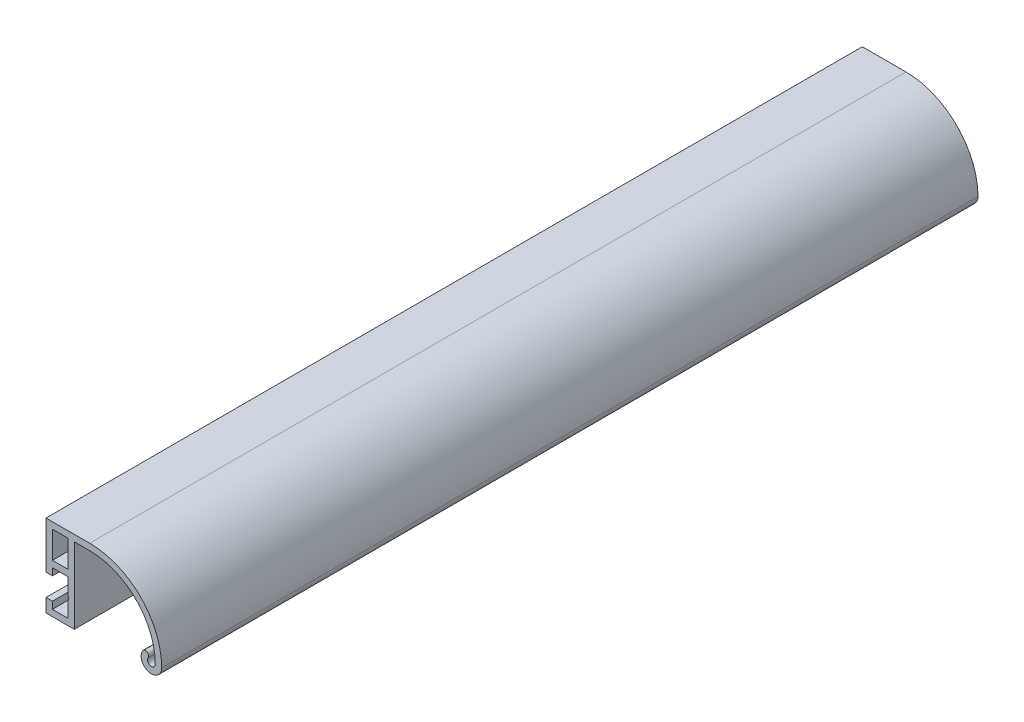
ISO-10303-21;
HEADER;
FILE_DESCRIPTION(('STEP AP214'),'2;1');
FILE_NAME('part.step','',(''),(''),'','','');
FILE_SCHEMA(('AUTOMOTIVE_DESIGN { 1 0 10303 214 1 1 1 1 }'));
ENDSEC;
DATA;
#1=APPLICATION_CONTEXT('core data for automotive mechanical design processes');
#2=APPLICATION_PROTOCOL_DEFINITION('international standard','automotive_design',2000,#1);
#3=PRODUCT_CONTEXT('',#1,'mechanical');
#4=PRODUCT('Part','Part','',(#3));
#5=PRODUCT_RELATED_PRODUCT_CATEGORY('part','',(#4));
#6=PRODUCT_DEFINITION_FORMATION('','',#4);
#7=PRODUCT_DEFINITION_CONTEXT('part definition',#1,'design');
#8=PRODUCT_DEFINITION('design','',#6,#7);
#9=PRODUCT_DEFINITION_SHAPE('','',#8);
#10=(LENGTH_UNIT() NAMED_UNIT(*) SI_UNIT(.MILLI.,.METRE.));
#11=(NAMED_UNIT(*) PLANE_ANGLE_UNIT() SI_UNIT($,.RADIAN.));
#12=(NAMED_UNIT(*) SI_UNIT($,.STERADIAN.) SOLID_ANGLE_UNIT());
#13=UNCERTAINTY_MEASURE_WITH_UNIT(LENGTH_MEASURE(1.E-05),#10,'distance_accuracy_value','');
#14=(GEOMETRIC_REPRESENTATION_CONTEXT(3) GLOBAL_UNCERTAINTY_ASSIGNED_CONTEXT((#13)) GLOBAL_UNIT_ASSIGNED_CONTEXT((#10,
#11,#12)) REPRESENTATION_CONTEXT('',''));
#15=CARTESIAN_POINT('',(0.,0.,0.));
#16=DIRECTION('',(0.,0.,1.));
#17=DIRECTION('',(1.,0.,0.));
#18=AXIS2_PLACEMENT_3D('',#15,#16,#17);
#19=CARTESIAN_POINT('',(-13.9999990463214,0.499999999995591,-158.75));
#20=DIRECTION('',(-0.707106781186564,-0.707106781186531,0.));
#21=DIRECTION('',(0.707106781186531,-0.707106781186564,0.));
#22=AXIS2_PLACEMENT_3D('',#19,#20,#21);
#23=PLANE('',#22);
#24=CARTESIAN_POINT('',(-13.4999990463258,0.,120.65));
#25=DIRECTION('',(-0.707106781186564,-0.707106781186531,0.));
#26=DIRECTION('',(0.707106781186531,-0.707106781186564,0.));
#27=AXIS2_PLACEMENT_3D('',#24,#25,#26);
#28=ELLIPSE('',#27,5.65685424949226,4.00000000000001);
#29=CARTESIAN_POINT('',(-13.4999990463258,0.,124.65));
#30=VERTEX_POINT('',#29);
#31=CARTESIAN_POINT('',(-13.9999990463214,0.499999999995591,124.618626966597));
#32=VERTEX_POINT('',#31);
#33=EDGE_CURVE('E60',#30,#32,#28,.T.);
#34=ORIENTED_EDGE('',*,*,#33,.F.);
#35=DIRECTION('',(0.,0.,1.));
#36=VECTOR('',#35,1.);
#37=CARTESIAN_POINT('',(-13.4999990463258,0.,-158.75));
#38=LINE('',#37,#36);
#39=CARTESIAN_POINT('',(-13.4999990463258,0.,158.75));
#40=VERTEX_POINT('',#39);
#41=EDGE_CURVE('E297',#30,#40,#38,.T.);
#42=ORIENTED_EDGE('',*,*,#41,.T.);
#43=DIRECTION('',(0.707106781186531,-0.707106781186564,0.));
#44=VECTOR('',#43,1.);
#45=CARTESIAN_POINT('',(-13.9999990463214,0.499999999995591,158.75));
#46=LINE('',#45,#44);
#47=CARTESIAN_POINT('',(-13.9999990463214,0.499999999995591,158.75));
#48=VERTEX_POINT('',#47);
#49=EDGE_CURVE('E394',#48,#40,#46,.T.);
#50=ORIENTED_EDGE('',*,*,#49,.F.);
#51=DIRECTION('',(0.,0.,1.));
#52=VECTOR('',#51,1.);
#53=CARTESIAN_POINT('',(-13.9999990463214,0.499999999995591,-158.75));
#54=LINE('',#53,#52);
#55=EDGE_CURVE('E292',#32,#48,#54,.T.);
#56=ORIENTED_EDGE('',*,*,#55,.F.);
#57=EDGE_LOOP('',(#34,#42,#50,#56));
#58=FACE_BOUND('',#57,.T.);
#59=ADVANCED_FACE('F39',(#58),#23,.T.);
#60=CARTESIAN_POINT('',(-13.4999990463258,0.,-158.75));
#61=DIRECTION('',(-0.70710678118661,0.707106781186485,0.));
#62=DIRECTION('',(-0.707106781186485,-0.70710678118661,0.));
#63=AXIS2_PLACEMENT_3D('',#60,#61,#62);
#64=PLANE('',#63);
#65=CARTESIAN_POINT('',(-13.4999990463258,0.,120.65));
#66=DIRECTION('',(-0.70710678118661,0.707106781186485,0.));
#67=DIRECTION('',(0.707106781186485,0.70710678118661,0.));
#68=AXIS2_PLACEMENT_3D('',#65,#66,#67);
#69=ELLIPSE('',#68,5.65685424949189,4.00000000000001);
#70=CARTESIAN_POINT('',(-13.4999990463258,0.,116.65));
#71=VERTEX_POINT('',#70);
#72=CARTESIAN_POINT('',(-13.9999990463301,-0.500000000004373,116.681373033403));
#73=VERTEX_POINT('',#72);
#74=EDGE_CURVE('E677',#71,#73,#69,.T.);
#75=ORIENTED_EDGE('',*,*,#74,.F.);
#76=CARTESIAN_POINT('',(-13.4999990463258,0.,-116.65));
#77=VERTEX_POINT('',#76);
#78=EDGE_CURVE('E284',#77,#71,#38,.T.);
#79=ORIENTED_EDGE('',*,*,#78,.F.);
#80=CARTESIAN_POINT('',(-13.4999990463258,0.,-120.65));
#81=DIRECTION('',(-0.70710678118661,0.707106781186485,0.));
#82=DIRECTION('',(0.707106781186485,0.70710678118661,0.));
#83=AXIS2_PLACEMENT_3D('',#80,#81,#82);
#84=ELLIPSE('',#83,5.65685424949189,4.00000000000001);
#85=CARTESIAN_POINT('',(-13.9999990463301,-0.500000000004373,-116.681373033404));
#86=VERTEX_POINT('',#85);
#87=EDGE_CURVE('E520',#86,#77,#84,.T.);
#88=ORIENTED_EDGE('',*,*,#87,.F.);
#89=DIRECTION('',(0.,0.,1.));
#90=VECTOR('',#89,1.);
#91=CARTESIAN_POINT('',(-13.9999990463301,-0.500000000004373,-158.75));
#92=LINE('',#91,#90);
#93=EDGE_CURVE('E370',#86,#73,#92,.T.);
#94=ORIENTED_EDGE('',*,*,#93,.T.);
#95=EDGE_LOOP('',(#75,#79,#88,#94));
#96=FACE_BOUND('',#95,.T.);
#97=ADVANCED_FACE('F652',(#96),#64,.T.);
#98=CARTESIAN_POINT('',(-13.4999990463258,0.,-124.65));
#99=VERTEX_POINT('',#98);
#100=CARTESIAN_POINT('',(-13.9999990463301,-0.500000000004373,-124.618626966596));
#101=VERTEX_POINT('',#100);
#102=EDGE_CURVE('E517',#99,#101,#84,.T.);
#103=ORIENTED_EDGE('',*,*,#102,.F.);
#104=CARTESIAN_POINT('',(-13.4999990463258,0.,-158.75));
#105=VERTEX_POINT('',#104);
#106=EDGE_CURVE('E302',#105,#99,#38,.T.);
#107=ORIENTED_EDGE('',*,*,#106,.F.);
#108=DIRECTION('',(-0.707106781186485,-0.70710678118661,0.));
#109=VECTOR('',#108,1.);
#110=CARTESIAN_POINT('',(-13.4999990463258,0.,-158.75));
#111=LINE('',#110,#109);
#112=CARTESIAN_POINT('',(-13.9999990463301,-0.500000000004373,-158.75));
#113=VERTEX_POINT('',#112);
#114=EDGE_CURVE('E501',#105,#113,#111,.T.);
#115=ORIENTED_EDGE('',*,*,#114,.T.);
#116=EDGE_CURVE('E367',#113,#101,#92,.T.);
#117=ORIENTED_EDGE('',*,*,#116,.T.);
#118=EDGE_LOOP('',(#103,#107,#115,#117));
#119=FACE_BOUND('',#118,.T.);
#120=ADVANCED_FACE('F516',(#119),#64,.T.);
#121=CARTESIAN_POINT('',(-13.9999990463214,0.499999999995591,116.681373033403));
#122=VERTEX_POINT('',#121);
#123=EDGE_CURVE('E270',#122,#71,#28,.T.);
#124=ORIENTED_EDGE('',*,*,#123,.F.);
#125=CARTESIAN_POINT('',(-13.9999990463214,0.499999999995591,-116.681373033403));
#126=VERTEX_POINT('',#125);
#127=EDGE_CURVE('E282',#126,#122,#54,.T.);
#128=ORIENTED_EDGE('',*,*,#127,.F.);
#129=CARTESIAN_POINT('',(-13.4999990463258,0.,-120.65));
#130=DIRECTION('',(-0.707106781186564,-0.707106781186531,0.));
#131=DIRECTION('',(0.707106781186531,-0.707106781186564,0.));
#132=AXIS2_PLACEMENT_3D('',#129,#130,#131);
#133=ELLIPSE('',#132,5.65685424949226,4.00000000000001);
#134=EDGE_CURVE('E68',#77,#126,#133,.T.);
#135=ORIENTED_EDGE('',*,*,#134,.F.);
#136=ORIENTED_EDGE('',*,*,#78,.T.);
#137=EDGE_LOOP('',(#124,#128,#135,#136));
#138=FACE_BOUND('',#137,.T.);
#139=ADVANCED_FACE('F281',(#138),#23,.T.);
#140=CARTESIAN_POINT('',(-19.9999990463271,-4.2500000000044,-158.75));
#141=DIRECTION('',(0.,1.,0.));
#142=DIRECTION('',(-1.,0.,0.));
#143=AXIS2_PLACEMENT_3D('',#140,#141,#142);
#144=PLANE('',#143);
#145=DIRECTION('',(0.,0.,1.));
#146=VECTOR('',#145,1.);
#147=CARTESIAN_POINT('',(-22.4999990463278,-4.25000000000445,-158.75));
#148=LINE('',#147,#146);
#149=CARTESIAN_POINT('',(-22.4999990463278,-4.25000000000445,-158.75));
#150=VERTEX_POINT('',#149);
#151=CARTESIAN_POINT('',(-22.4999990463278,-4.25000000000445,158.75));
#152=VERTEX_POINT('',#151);
#153=EDGE_CURVE('E43',#150,#152,#148,.T.);
#154=ORIENTED_EDGE('',*,*,#153,.T.);
#155=DIRECTION('',(-1.,0.,0.));
#156=VECTOR('',#155,1.);
#157=CARTESIAN_POINT('',(-19.9999990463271,-4.2500000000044,158.75));
#158=LINE('',#157,#156);
#159=CARTESIAN_POINT('',(-19.9999990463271,-4.2500000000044,158.75));
#160=VERTEX_POINT('',#159);
#161=EDGE_CURVE('E540',#160,#152,#158,.T.);
#162=ORIENTED_EDGE('',*,*,#161,.F.);
#163=DIRECTION('',(0.,0.,1.));
#164=VECTOR('',#163,1.);
#165=CARTESIAN_POINT('',(-19.9999990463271,-4.2500000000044,-158.75));
#166=LINE('',#165,#164);
#167=CARTESIAN_POINT('',(-19.9999990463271,-4.2500000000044,-158.75));
#168=VERTEX_POINT('',#167);
#169=EDGE_CURVE('E11',#168,#160,#166,.T.);
#170=ORIENTED_EDGE('',*,*,#169,.F.);
#171=DIRECTION('',(-1.,0.,0.));
#172=VECTOR('',#171,1.);
#173=CARTESIAN_POINT('',(-19.9999990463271,-4.2500000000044,-158.75));
#174=LINE('',#173,#172);
#175=EDGE_CURVE('E435',#168,#150,#174,.T.);
#176=ORIENTED_EDGE('',*,*,#175,.T.);
#177=EDGE_LOOP('',(#154,#162,#170,#176));
#178=FACE_BOUND('',#177,.T.);
#179=ADVANCED_FACE('F41',(#178),#144,.T.);
#180=CARTESIAN_POINT('',(-19.9999990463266,-7.0000000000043,-158.75));
#181=DIRECTION('',(1.,1.58963751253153E-13,0.));
#182=DIRECTION('',(-1.58963751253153E-13,1.,0.));
#183=AXIS2_PLACEMENT_3D('',#180,#181,#182);
#184=PLANE('',#183);
#185=ORIENTED_EDGE('',*,*,#169,.T.);
#186=DIRECTION('',(-1.58963751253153E-13,1.,0.));
#187=VECTOR('',#186,1.);
#188=CARTESIAN_POINT('',(-19.9999990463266,-7.0000000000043,158.75));
#189=LINE('',#188,#187);
#190=CARTESIAN_POINT('',(-19.9999990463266,-7.0000000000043,158.75));
#191=VERTEX_POINT('',#190);
#192=EDGE_CURVE('E416',#191,#160,#189,.T.);
#193=ORIENTED_EDGE('',*,*,#192,.F.);
#194=DIRECTION('',(0.,0.,1.));
#195=VECTOR('',#194,1.);
#196=CARTESIAN_POINT('',(-19.9999990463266,-7.0000000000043,-158.75));
#197=LINE('',#196,#195);
#198=CARTESIAN_POINT('',(-19.9999990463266,-7.0000000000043,-158.75));
#199=VERTEX_POINT('',#198);
#200=EDGE_CURVE('E49',#199,#191,#197,.T.);
#201=ORIENTED_EDGE('',*,*,#200,.F.);
#202=DIRECTION('',(-1.58963751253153E-13,1.,0.));
#203=VECTOR('',#202,1.);
#204=CARTESIAN_POINT('',(-19.9999990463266,-7.0000000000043,-158.75));
#205=LINE('',#204,#203);
#206=EDGE_CURVE('E345',#199,#168,#205,.T.);
#207=ORIENTED_EDGE('',*,*,#206,.T.);
#208=EDGE_LOOP('',(#185,#193,#201,#207));
#209=FACE_BOUND('',#208,.T.);
#210=ADVANCED_FACE('F639',(#209),#184,.T.);
#211=CARTESIAN_POINT('',(-13.9999990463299,-7.00000000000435,-158.75));
#212=DIRECTION('',(0.,1.,0.));
#213=DIRECTION('',(-1.,0.,0.));
#214=AXIS2_PLACEMENT_3D('',#211,#212,#213);
#215=PLANE('',#214);
#216=ORIENTED_EDGE('',*,*,#200,.T.);
#217=DIRECTION('',(-1.,0.,0.));
#218=VECTOR('',#217,1.);
#219=CARTESIAN_POINT('',(-13.9999990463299,-7.00000000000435,158.75));
#220=LINE('',#219,#218);
#221=CARTESIAN_POINT('',(-13.9999990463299,-7.00000000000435,158.75));
#222=VERTEX_POINT('',#221);
#223=EDGE_CURVE('E410',#222,#191,#220,.T.);
#224=ORIENTED_EDGE('',*,*,#223,.F.);
#225=DIRECTION('',(0.,0.,1.));
#226=VECTOR('',#225,1.);
#227=CARTESIAN_POINT('',(-13.9999990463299,-7.00000000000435,-158.75));
#228=LINE('',#227,#226);
#229=CARTESIAN_POINT('',(-13.9999990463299,-7.00000000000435,-158.75));
#230=VERTEX_POINT('',#229);
#231=EDGE_CURVE('E366',#230,#222,#228,.T.);
#232=ORIENTED_EDGE('',*,*,#231,.F.);
#233=DIRECTION('',(-1.,0.,0.));
#234=VECTOR('',#233,1.);
#235=CARTESIAN_POINT('',(-13.9999990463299,-7.00000000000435,-158.75));
#236=LINE('',#235,#234);
#237=EDGE_CURVE('E352',#230,#199,#236,.T.);
#238=ORIENTED_EDGE('',*,*,#237,.T.);
#239=EDGE_LOOP('',(#216,#224,#232,#238));
#240=FACE_BOUND('',#239,.T.);
#241=ADVANCED_FACE('F642',(#240),#215,.T.);
#242=CARTESIAN_POINT('',(-13.9999990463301,-0.500000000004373,-158.75));
#243=DIRECTION('',(-1.,0.,0.));
#244=DIRECTION('',(0.,-1.,0.));
#245=AXIS2_PLACEMENT_3D('',#242,#243,#244);
#246=PLANE('',#245);
#247=CARTESIAN_POINT('',(-13.9999990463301,0.,120.65));
#248=DIRECTION('',(-1.,0.,0.));
#249=DIRECTION('',(0.,-1.,0.));
#250=AXIS2_PLACEMENT_3D('',#247,#248,#249);
#251=CIRCLE('',#250,4.00000000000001);
#252=CARTESIAN_POINT('',(-13.9999990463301,-0.500000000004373,124.618626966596));
#253=VERTEX_POINT('',#252);
#254=EDGE_CURVE('E672',#73,#253,#251,.T.);
#255=ORIENTED_EDGE('',*,*,#254,.F.);
#256=ORIENTED_EDGE('',*,*,#93,.F.);
#257=CARTESIAN_POINT('',(-13.9999990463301,0.,-120.65));
#258=DIRECTION('',(-1.,0.,0.));
#259=DIRECTION('',(0.,-1.,0.));
#260=AXIS2_PLACEMENT_3D('',#257,#258,#259);
#261=CIRCLE('',#260,4.00000000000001);
#262=EDGE_CURVE('E519',#101,#86,#261,.T.);
#263=ORIENTED_EDGE('',*,*,#262,.F.);
#264=ORIENTED_EDGE('',*,*,#116,.F.);
#265=DIRECTION('',(0.,-1.,0.));
#266=VECTOR('',#265,1.);
#267=CARTESIAN_POINT('',(-13.9999990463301,-0.500000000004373,-158.75));
#268=LINE('',#267,#266);
#269=EDGE_CURVE('E360',#113,#230,#268,.T.);
#270=ORIENTED_EDGE('',*,*,#269,.T.);
#271=ORIENTED_EDGE('',*,*,#231,.T.);
#272=DIRECTION('',(0.,-1.,0.));
#273=VECTOR('',#272,1.);
#274=CARTESIAN_POINT('',(-13.9999990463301,-0.500000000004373,158.75));
#275=LINE('',#274,#273);
#276=CARTESIAN_POINT('',(-13.9999990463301,-0.500000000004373,158.75));
#277=VERTEX_POINT('',#276);
#278=EDGE_CURVE('E408',#277,#222,#275,.T.);
#279=ORIENTED_EDGE('',*,*,#278,.F.);
#280=EDGE_CURVE('E371',#253,#277,#92,.T.);
#281=ORIENTED_EDGE('',*,*,#280,.F.);
#282=EDGE_LOOP('',(#255,#256,#263,#264,#270,#271,#279,#281));
#283=FACE_BOUND('',#282,.T.);
#284=ADVANCED_FACE('F508',(#283),#246,.T.);
#285=EDGE_CURVE('E678',#253,#30,#69,.T.);
#286=ORIENTED_EDGE('',*,*,#285,.F.);
#287=ORIENTED_EDGE('',*,*,#280,.T.);
#288=DIRECTION('',(-0.707106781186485,-0.70710678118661,0.));
#289=VECTOR('',#288,1.);
#290=CARTESIAN_POINT('',(-13.4999990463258,0.,158.75));
#291=LINE('',#290,#289);
#292=EDGE_CURVE('E401',#40,#277,#291,.T.);
#293=ORIENTED_EDGE('',*,*,#292,.F.);
#294=ORIENTED_EDGE('',*,*,#41,.F.);
#295=EDGE_LOOP('',(#286,#287,#293,#294));
#296=FACE_BOUND('',#295,.T.);
#297=ADVANCED_FACE('F407',(#296),#64,.T.);
#298=CARTESIAN_POINT('',(-13.9999990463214,0.499999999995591,-124.618626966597));
#299=VERTEX_POINT('',#298);
#300=EDGE_CURVE('E526',#299,#99,#133,.T.);
#301=ORIENTED_EDGE('',*,*,#300,.F.);
#302=CARTESIAN_POINT('',(-13.9999990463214,0.499999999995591,-158.75));
#303=VERTEX_POINT('',#302);
#304=EDGE_CURVE('E291',#303,#299,#54,.T.);
#305=ORIENTED_EDGE('',*,*,#304,.F.);
#306=DIRECTION('',(0.707106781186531,-0.707106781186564,0.));
#307=VECTOR('',#306,1.);
#308=CARTESIAN_POINT('',(-13.9999990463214,0.499999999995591,-158.75));
#309=LINE('',#308,#307);
#310=EDGE_CURVE('E498',#303,#105,#309,.T.);
#311=ORIENTED_EDGE('',*,*,#310,.T.);
#312=ORIENTED_EDGE('',*,*,#106,.T.);
#313=EDGE_LOOP('',(#301,#305,#311,#312));
#314=FACE_BOUND('',#313,.T.);
#315=ADVANCED_FACE('F654',(#314),#23,.T.);
#316=CARTESIAN_POINT('',(-13.9999990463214,6.99999999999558,-158.75));
#317=DIRECTION('',(-1.,0.,0.));
#318=DIRECTION('',(0.,-1.,0.));
#319=AXIS2_PLACEMENT_3D('',#316,#317,#318);
#320=PLANE('',#319);
#321=CARTESIAN_POINT('',(-13.9999990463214,0.,120.65));
#322=DIRECTION('',(-1.,0.,0.));
#323=DIRECTION('',(0.,-1.,0.));
#324=AXIS2_PLACEMENT_3D('',#321,#322,#323);
#325=CIRCLE('',#324,4.00000000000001);
#326=EDGE_CURVE('E266',#32,#122,#325,.T.);
#327=ORIENTED_EDGE('',*,*,#326,.F.);
#328=ORIENTED_EDGE('',*,*,#55,.T.);
#329=DIRECTION('',(0.,-1.,0.));
#330=VECTOR('',#329,1.);
#331=CARTESIAN_POINT('',(-13.9999990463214,6.99999999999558,158.75));
#332=LINE('',#331,#330);
#333=CARTESIAN_POINT('',(-13.9999990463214,6.99999999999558,158.75));
#334=VERTEX_POINT('',#333);
#335=EDGE_CURVE('E405',#334,#48,#332,.T.);
#336=ORIENTED_EDGE('',*,*,#335,.F.);
#337=DIRECTION('',(0.,0.,1.));
#338=VECTOR('',#337,1.);
#339=CARTESIAN_POINT('',(-13.9999990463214,6.99999999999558,-158.75));
#340=LINE('',#339,#338);
#341=CARTESIAN_POINT('',(-13.9999990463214,6.99999999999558,-158.75));
#342=VERTEX_POINT('',#341);
#343=EDGE_CURVE('E299',#342,#334,#340,.T.);
#344=ORIENTED_EDGE('',*,*,#343,.F.);
#345=DIRECTION('',(0.,-1.,0.));
#346=VECTOR('',#345,1.);
#347=CARTESIAN_POINT('',(-13.9999990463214,6.99999999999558,-158.75));
#348=LINE('',#347,#346);
#349=EDGE_CURVE('E494',#342,#303,#348,.T.);
#350=ORIENTED_EDGE('',*,*,#349,.T.);
#351=ORIENTED_EDGE('',*,*,#304,.T.);
#352=CARTESIAN_POINT('',(-13.9999990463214,0.,-120.65));
#353=DIRECTION('',(-1.,0.,0.));
#354=DIRECTION('',(0.,-1.,0.));
#355=AXIS2_PLACEMENT_3D('',#352,#353,#354);
#356=CIRCLE('',#355,4.00000000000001);
#357=EDGE_CURVE('E289',#126,#299,#356,.T.);
#358=ORIENTED_EDGE('',*,*,#357,.F.);
#359=ORIENTED_EDGE('',*,*,#127,.T.);
#360=EDGE_LOOP('',(#327,#328,#336,#344,#350,#351,#358,#359));
#361=FACE_BOUND('',#360,.T.);
#362=ADVANCED_FACE('F287',(#361),#320,.T.);
#363=CARTESIAN_POINT('',(-19.9999990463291,6.99999999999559,-158.75));
#364=DIRECTION('',(0.,-1.,0.));
#365=DIRECTION('',(1.,0.,0.));
#366=AXIS2_PLACEMENT_3D('',#363,#364,#365);
#367=PLANE('',#366);
#368=ORIENTED_EDGE('',*,*,#343,.T.);
#369=DIRECTION('',(1.,0.,0.));
#370=VECTOR('',#369,1.);
#371=CARTESIAN_POINT('',(-19.9999990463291,6.99999999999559,158.75));
#372=LINE('',#371,#370);
#373=CARTESIAN_POINT('',(-19.9999990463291,6.99999999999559,158.75));
#374=VERTEX_POINT('',#373);
#375=EDGE_CURVE('E582',#374,#334,#372,.T.);
#376=ORIENTED_EDGE('',*,*,#375,.F.);
#377=DIRECTION('',(0.,0.,1.));
#378=VECTOR('',#377,1.);
#379=CARTESIAN_POINT('',(-19.9999990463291,6.99999999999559,-158.75));
#380=LINE('',#379,#378);
#381=CARTESIAN_POINT('',(-19.9999990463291,6.99999999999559,-158.75));
#382=VERTEX_POINT('',#381);
#383=EDGE_CURVE('E306',#382,#374,#380,.T.);
#384=ORIENTED_EDGE('',*,*,#383,.F.);
#385=DIRECTION('',(1.,0.,0.));
#386=VECTOR('',#385,1.);
#387=CARTESIAN_POINT('',(-19.9999990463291,6.99999999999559,-158.75));
#388=LINE('',#387,#386);
#389=EDGE_CURVE('E491',#382,#342,#388,.T.);
#390=ORIENTED_EDGE('',*,*,#389,.T.);
#391=EDGE_LOOP('',(#368,#376,#384,#390));
#392=FACE_BOUND('',#391,.T.);
#393=ADVANCED_FACE('F589',(#392),#367,.T.);
#394=CARTESIAN_POINT('',(-19.9999990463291,4.24999999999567,-158.75));
#395=DIRECTION('',(1.,0.,0.));
#396=DIRECTION('',(0.,1.,0.));
#397=AXIS2_PLACEMENT_3D('',#394,#395,#396);
#398=PLANE('',#397);
#399=ORIENTED_EDGE('',*,*,#383,.T.);
#400=DIRECTION('',(0.,1.,0.));
#401=VECTOR('',#400,1.);
#402=CARTESIAN_POINT('',(-19.9999990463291,4.24999999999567,158.75));
#403=LINE('',#402,#401);
#404=CARTESIAN_POINT('',(-19.9999990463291,4.24999999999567,158.75));
#405=VERTEX_POINT('',#404);
#406=EDGE_CURVE('E579',#405,#374,#403,.T.);
#407=ORIENTED_EDGE('',*,*,#406,.F.);
#408=DIRECTION('',(0.,0.,1.));
#409=VECTOR('',#408,1.);
#410=CARTESIAN_POINT('',(-19.9999990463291,4.24999999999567,-158.75));
#411=LINE('',#410,#409);
#412=CARTESIAN_POINT('',(-19.9999990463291,4.24999999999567,-158.75));
#413=VERTEX_POINT('',#412);
#414=EDGE_CURVE('E309',#413,#405,#411,.T.);
#415=ORIENTED_EDGE('',*,*,#414,.F.);
#416=DIRECTION('',(0.,1.,0.));
#417=VECTOR('',#416,1.);
#418=CARTESIAN_POINT('',(-19.9999990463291,4.24999999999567,-158.75));
#419=LINE('',#418,#417);
#420=EDGE_CURVE('E487',#413,#382,#419,.T.);
#421=ORIENTED_EDGE('',*,*,#420,.T.);
#422=EDGE_LOOP('',(#399,#407,#415,#421));
#423=FACE_BOUND('',#422,.T.);
#424=ADVANCED_FACE('F591',(#423),#398,.T.);
#425=CARTESIAN_POINT('',(-22.4999990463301,4.2499999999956,-158.75));
#426=DIRECTION('',(0.,-1.,0.));
#427=DIRECTION('',(1.,0.,0.));
#428=AXIS2_PLACEMENT_3D('',#425,#426,#427);
#429=PLANE('',#428);
#430=ORIENTED_EDGE('',*,*,#414,.T.);
#431=DIRECTION('',(1.,0.,0.));
#432=VECTOR('',#431,1.);
#433=CARTESIAN_POINT('',(-22.4999990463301,4.2499999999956,158.75));
#434=LINE('',#433,#432);
#435=CARTESIAN_POINT('',(-22.4999990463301,4.2499999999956,158.75));
#436=VERTEX_POINT('',#435);
#437=EDGE_CURVE('E576',#436,#405,#434,.T.);
#438=ORIENTED_EDGE('',*,*,#437,.F.);
#439=DIRECTION('',(0.,0.,1.));
#440=VECTOR('',#439,1.);
#441=CARTESIAN_POINT('',(-22.4999990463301,4.2499999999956,-158.75));
#442=LINE('',#441,#440);
#443=CARTESIAN_POINT('',(-22.4999990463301,4.2499999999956,-158.75));
#444=VERTEX_POINT('',#443);
#445=EDGE_CURVE('E312',#444,#436,#442,.T.);
#446=ORIENTED_EDGE('',*,*,#445,.F.);
#447=DIRECTION('',(1.,0.,0.));
#448=VECTOR('',#447,1.);
#449=CARTESIAN_POINT('',(-22.4999990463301,4.2499999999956,-158.75));
#450=LINE('',#449,#448);
#451=EDGE_CURVE('E483',#444,#413,#450,.T.);
#452=ORIENTED_EDGE('',*,*,#451,.T.);
#453=EDGE_LOOP('',(#430,#438,#446,#452));
#454=FACE_BOUND('',#453,.T.);
#455=ADVANCED_FACE('F595',(#454),#429,.T.);
#456=CARTESIAN_POINT('',(-22.4999990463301,22.499998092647,-158.75));
#457=DIRECTION('',(-1.,0.,0.));
#458=DIRECTION('',(0.,0.,1.));
#459=AXIS2_PLACEMENT_3D('',#456,#457,#458);
#460=PLANE('',#459);
#461=ORIENTED_EDGE('',*,*,#445,.T.);
#462=DIRECTION('',(0.,-1.,0.));
#463=VECTOR('',#462,1.);
#464=CARTESIAN_POINT('',(-22.4999990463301,22.499998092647,158.75));
#465=LINE('',#464,#463);
#466=CARTESIAN_POINT('',(-22.4999990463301,22.499998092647,158.75));
#467=VERTEX_POINT('',#466);
#468=EDGE_CURVE('E573',#467,#436,#465,.T.);
#469=ORIENTED_EDGE('',*,*,#468,.F.);
#470=DIRECTION('',(0.,0.,1.));
#471=VECTOR('',#470,1.);
#472=CARTESIAN_POINT('',(-22.4999990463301,22.499998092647,-158.75));
#473=LINE('',#472,#471);
#474=CARTESIAN_POINT('',(-22.4999990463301,22.499998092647,-158.75));
#475=VERTEX_POINT('',#474);
#476=EDGE_CURVE('E315',#475,#467,#473,.T.);
#477=ORIENTED_EDGE('',*,*,#476,.F.);
#478=DIRECTION('',(0.,-1.,0.));
#479=VECTOR('',#478,1.);
#480=CARTESIAN_POINT('',(-22.4999990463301,22.499998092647,-158.75));
#481=LINE('',#480,#479);
#482=EDGE_CURVE('E479',#475,#444,#481,.T.);
#483=ORIENTED_EDGE('',*,*,#482,.T.);
#484=EDGE_LOOP('',(#461,#469,#477,#483));
#485=FACE_BOUND('',#484,.T.);
#486=ADVANCED_FACE('F599',(#485),#460,.T.);
#487=CARTESIAN_POINT('',(-5.4999990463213,22.499998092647,-158.75));
#488=DIRECTION('',(0.,1.,0.));
#489=DIRECTION('',(-1.,0.,0.));
#490=AXIS2_PLACEMENT_3D('',#487,#488,#489);
#491=PLANE('',#490);
#492=ORIENTED_EDGE('',*,*,#476,.T.);
#493=DIRECTION('',(-1.,0.,0.));
#494=VECTOR('',#493,1.);
#495=CARTESIAN_POINT('',(-5.4999990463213,22.499998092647,158.75));
#496=LINE('',#495,#494);
#497=CARTESIAN_POINT('',(-5.4999990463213,22.499998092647,158.75));
#498=VERTEX_POINT('',#497);
#499=EDGE_CURVE('E570',#498,#467,#496,.T.);
#500=ORIENTED_EDGE('',*,*,#499,.F.);
#501=DIRECTION('',(0.,0.,1.));
#502=VECTOR('',#501,1.);
#503=CARTESIAN_POINT('',(-5.4999990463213,22.499998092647,-158.75));
#504=LINE('',#503,#502);
#505=CARTESIAN_POINT('',(-5.4999990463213,22.499998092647,-158.75));
#506=VERTEX_POINT('',#505);
#507=EDGE_CURVE('E317',#506,#498,#504,.T.);
#508=ORIENTED_EDGE('',*,*,#507,.F.);
#509=DIRECTION('',(-1.,0.,0.));
#510=VECTOR('',#509,1.);
#511=CARTESIAN_POINT('',(-5.4999990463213,22.499998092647,-158.75));
#512=LINE('',#511,#510);
#513=EDGE_CURVE('E476',#506,#475,#512,.T.);
#514=ORIENTED_EDGE('',*,*,#513,.T.);
#515=EDGE_LOOP('',(#492,#500,#508,#514));
#516=FACE_BOUND('',#515,.T.);
#517=ADVANCED_FACE('F603',(#516),#491,.T.);
#518=CARTESIAN_POINT('',(-5.49999904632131,-5.50000000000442,-158.75));
#519=DIRECTION('',(0.,0.,1.));
#520=DIRECTION('',(1.,0.,0.));
#521=AXIS2_PLACEMENT_3D('',#518,#519,#520);
#522=CYLINDRICAL_SURFACE('',#521,27.9999980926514);
#523=ORIENTED_EDGE('',*,*,#507,.T.);
#524=CARTESIAN_POINT('',(-5.49999904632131,-5.50000000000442,158.75));
#525=DIRECTION('',(0.,0.,1.));
#526=DIRECTION('',(1.,0.,0.));
#527=AXIS2_PLACEMENT_3D('',#524,#525,#526);
#528=CIRCLE('',#527,27.9999980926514);
#529=CARTESIAN_POINT('',(22.4999990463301,-5.50000000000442,158.75));
#530=VERTEX_POINT('',#529);
#531=EDGE_CURVE('E567',#530,#498,#528,.T.);
#532=ORIENTED_EDGE('',*,*,#531,.F.);
#533=DIRECTION('',(0.,0.,1.));
#534=VECTOR('',#533,1.);
#535=CARTESIAN_POINT('',(22.4999990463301,-5.50000000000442,-158.75));
#536=LINE('',#535,#534);
#537=CARTESIAN_POINT('',(22.4999990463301,-5.50000000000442,-158.75));
#538=VERTEX_POINT('',#537);
#539=EDGE_CURVE('E319',#538,#530,#536,.T.);
#540=ORIENTED_EDGE('',*,*,#539,.F.);
#541=CARTESIAN_POINT('',(-5.49999904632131,-5.50000000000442,-158.75));
#542=DIRECTION('',(0.,0.,1.));
#543=DIRECTION('',(1.,0.,0.));
#544=AXIS2_PLACEMENT_3D('',#541,#542,#543);
#545=CIRCLE('',#544,27.9999980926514);
#546=EDGE_CURVE('E472',#538,#506,#545,.T.);
#547=ORIENTED_EDGE('',*,*,#546,.T.);
#548=EDGE_LOOP('',(#523,#532,#540,#547));
#549=FACE_BOUND('',#548,.T.);
#550=ADVANCED_FACE('F608',(#549),#522,.T.);
#551=CARTESIAN_POINT('',(18.4999983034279,-5.50000000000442,-158.75));
#552=DIRECTION('',(0.,0.,1.));
#553=DIRECTION('',(1.,0.,0.));
#554=AXIS2_PLACEMENT_3D('',#551,#552,#553);
#555=CYLINDRICAL_SURFACE('',#554,4.00000074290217);
#556=ORIENTED_EDGE('',*,*,#539,.T.);
#557=CARTESIAN_POINT('',(18.4999983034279,-5.50000000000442,158.75));
#558=DIRECTION('',(0.,0.,1.));
#559=DIRECTION('',(1.,0.,0.));
#560=AXIS2_PLACEMENT_3D('',#557,#558,#559);
#561=CIRCLE('',#560,4.00000074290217);
#562=CARTESIAN_POINT('',(15.1439566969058,-3.32353711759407,158.75));
#563=VERTEX_POINT('',#562);
#564=EDGE_CURVE('E564',#563,#530,#561,.T.);
#565=ORIENTED_EDGE('',*,*,#564,.F.);
#566=DIRECTION('',(0.,0.,1.));
#567=VECTOR('',#566,1.);
#568=CARTESIAN_POINT('',(15.1439566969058,-3.32353711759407,-158.75));
#569=LINE('',#568,#567);
#570=CARTESIAN_POINT('',(15.1439566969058,-3.32353711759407,-158.75));
#571=VERTEX_POINT('',#570);
#572=EDGE_CURVE('E322',#571,#563,#569,.T.);
#573=ORIENTED_EDGE('',*,*,#572,.F.);
#574=CARTESIAN_POINT('',(18.4999983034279,-5.50000000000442,-158.75));
#575=DIRECTION('',(0.,0.,1.));
#576=DIRECTION('',(1.,0.,0.));
#577=AXIS2_PLACEMENT_3D('',#574,#575,#576);
#578=CIRCLE('',#577,4.00000074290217);
#579=EDGE_CURVE('E468',#571,#538,#578,.T.);
#580=ORIENTED_EDGE('',*,*,#579,.T.);
#581=EDGE_LOOP('',(#556,#565,#573,#580));
#582=FACE_BOUND('',#581,.T.);
#583=ADVANCED_FACE('F611',(#582),#555,.T.);
#584=CARTESIAN_POINT('',(16.1927195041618,-4.00368164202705,-158.75));
#585=DIRECTION('',(0.,0.,1.));
#586=DIRECTION('',(1.,0.,0.));
#587=AXIS2_PLACEMENT_3D('',#584,#585,#586);
#588=CYLINDRICAL_SURFACE('',#587,1.24999999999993);
#589=ORIENTED_EDGE('',*,*,#572,.T.);
#590=CARTESIAN_POINT('',(16.1927195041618,-4.00368164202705,158.75));
#591=DIRECTION('',(0.,0.,1.));
#592=DIRECTION('',(1.,0.,0.));
#593=AXIS2_PLACEMENT_3D('',#590,#591,#592);
#594=CIRCLE('',#593,1.24999999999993);
#595=CARTESIAN_POINT('',(17.2414823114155,-4.68382616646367,158.75));
#596=VERTEX_POINT('',#595);
#597=EDGE_CURVE('E561',#596,#563,#594,.T.);
#598=ORIENTED_EDGE('',*,*,#597,.F.);
#599=DIRECTION('',(0.,0.,1.));
#600=VECTOR('',#599,1.);
#601=CARTESIAN_POINT('',(17.2414823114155,-4.68382616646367,-158.75));
#602=LINE('',#601,#600);
#603=CARTESIAN_POINT('',(17.2414823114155,-4.68382616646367,-158.75));
#604=VERTEX_POINT('',#603);
#605=EDGE_CURVE('E325',#604,#596,#602,.T.);
#606=ORIENTED_EDGE('',*,*,#605,.F.);
#607=CARTESIAN_POINT('',(16.1927195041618,-4.00368164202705,-158.75));
#608=DIRECTION('',(0.,0.,1.));
#609=DIRECTION('',(1.,0.,0.));
#610=AXIS2_PLACEMENT_3D('',#607,#608,#609);
#611=CIRCLE('',#610,1.24999999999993);
#612=EDGE_CURVE('E464',#604,#571,#611,.T.);
#613=ORIENTED_EDGE('',*,*,#612,.T.);
#614=EDGE_LOOP('',(#589,#598,#606,#613));
#615=FACE_BOUND('',#614,.T.);
#616=ADVANCED_FACE('F615',(#615),#588,.T.);
#617=CARTESIAN_POINT('',(18.4999983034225,-5.50000000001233,-158.75));
#618=DIRECTION('',(0.,0.,1.));
#619=DIRECTION('',(1.,0.,0.));
#620=AXIS2_PLACEMENT_3D('',#617,#618,#619);
#621=CYLINDRICAL_SURFACE('',#620,1.50000074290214);
#622=ORIENTED_EDGE('',*,*,#605,.T.);
#623=CARTESIAN_POINT('',(18.4999983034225,-5.50000000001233,158.75));
#624=DIRECTION('',(0.,0.,-1.));
#625=DIRECTION('',(1.,0.,0.));
#626=AXIS2_PLACEMENT_3D('',#623,#624,#625);
#627=CIRCLE('',#626,1.50000074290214);
#628=CARTESIAN_POINT('',(19.9999990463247,-5.49999998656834,158.75));
#629=VERTEX_POINT('',#628);
#630=EDGE_CURVE('E558',#629,#596,#627,.T.);
#631=ORIENTED_EDGE('',*,*,#630,.F.);
#632=DIRECTION('',(0.,0.,1.));
#633=VECTOR('',#632,1.);
#634=CARTESIAN_POINT('',(19.9999990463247,-5.49999998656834,-158.75));
#635=LINE('',#634,#633);
#636=CARTESIAN_POINT('',(19.9999990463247,-5.49999998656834,-158.75));
#637=VERTEX_POINT('',#636);
#638=EDGE_CURVE('E328',#637,#629,#635,.T.);
#639=ORIENTED_EDGE('',*,*,#638,.F.);
#640=CARTESIAN_POINT('',(18.4999983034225,-5.50000000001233,-158.75));
#641=DIRECTION('',(0.,0.,-1.));
#642=DIRECTION('',(1.,0.,0.));
#643=AXIS2_PLACEMENT_3D('',#640,#641,#642);
#644=CIRCLE('',#643,1.50000074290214);
#645=EDGE_CURVE('E460',#637,#604,#644,.T.);
#646=ORIENTED_EDGE('',*,*,#645,.T.);
#647=EDGE_LOOP('',(#622,#631,#639,#646));
#648=FACE_BOUND('',#647,.T.);
#649=ADVANCED_FACE('F620',(#648),#621,.F.);
#650=CARTESIAN_POINT('',(-5.49999904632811,-5.50000043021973,-158.75));
#651=DIRECTION('',(0.,0.,1.));
#652=DIRECTION('',(1.,0.,0.));
#653=AXIS2_PLACEMENT_3D('',#650,#651,#652);
#654=CYLINDRICAL_SURFACE('',#653,25.4999980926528);
#655=ORIENTED_EDGE('',*,*,#638,.T.);
#656=CARTESIAN_POINT('',(-5.49999904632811,-5.50000043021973,158.75));
#657=DIRECTION('',(0.,0.,-1.));
#658=DIRECTION('',(1.,0.,0.));
#659=AXIS2_PLACEMENT_3D('',#656,#657,#658);
#660=CIRCLE('',#659,25.4999980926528);
#661=CARTESIAN_POINT('',(-5.49999904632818,19.9999976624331,158.75));
#662=VERTEX_POINT('',#661);
#663=EDGE_CURVE('E555',#662,#629,#660,.T.);
#664=ORIENTED_EDGE('',*,*,#663,.F.);
#665=DIRECTION('',(0.,0.,1.));
#666=VECTOR('',#665,1.);
#667=CARTESIAN_POINT('',(-5.49999904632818,19.9999976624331,-158.75));
#668=LINE('',#667,#666);
#669=CARTESIAN_POINT('',(-5.49999904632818,19.9999976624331,-158.75));
#670=VERTEX_POINT('',#669);
#671=EDGE_CURVE('E331',#670,#662,#668,.T.);
#672=ORIENTED_EDGE('',*,*,#671,.F.);
#673=CARTESIAN_POINT('',(-5.49999904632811,-5.50000043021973,-158.75));
#674=DIRECTION('',(0.,0.,-1.));
#675=DIRECTION('',(1.,0.,0.));
#676=AXIS2_PLACEMENT_3D('',#673,#674,#675);
#677=CIRCLE('',#676,25.4999980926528);
#678=EDGE_CURVE('E456',#670,#637,#677,.T.);
#679=ORIENTED_EDGE('',*,*,#678,.T.);
#680=EDGE_LOOP('',(#655,#664,#672,#679));
#681=FACE_BOUND('',#680,.T.);
#682=ADVANCED_FACE('F623',(#681),#654,.F.);
#683=CARTESIAN_POINT('',(-11.4999990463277,19.9999976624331,-158.75));
#684=DIRECTION('',(0.,-1.,0.));
#685=DIRECTION('',(0.,0.,-1.));
#686=AXIS2_PLACEMENT_3D('',#683,#684,#685);
#687=PLANE('',#686);
#688=ORIENTED_EDGE('',*,*,#671,.T.);
#689=DIRECTION('',(1.,0.,0.));
#690=VECTOR('',#689,1.);
#691=CARTESIAN_POINT('',(-11.4999990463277,19.9999976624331,158.75));
#692=LINE('',#691,#690);
#693=CARTESIAN_POINT('',(-11.4999990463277,19.9999976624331,158.75));
#694=VERTEX_POINT('',#693);
#695=EDGE_CURVE('E552',#694,#662,#692,.T.);
#696=ORIENTED_EDGE('',*,*,#695,.F.);
#697=DIRECTION('',(0.,0.,1.));
#698=VECTOR('',#697,1.);
#699=CARTESIAN_POINT('',(-11.4999990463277,19.9999976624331,-158.75));
#700=LINE('',#699,#698);
#701=CARTESIAN_POINT('',(-11.4999990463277,19.9999976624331,-158.75));
#702=VERTEX_POINT('',#701);
#703=EDGE_CURVE('E333',#702,#694,#700,.T.);
#704=ORIENTED_EDGE('',*,*,#703,.F.);
#705=DIRECTION('',(1.,0.,0.));
#706=VECTOR('',#705,1.);
#707=CARTESIAN_POINT('',(-11.4999990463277,19.9999976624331,-158.75));
#708=LINE('',#707,#706);
#709=EDGE_CURVE('E453',#702,#670,#708,.T.);
#710=ORIENTED_EDGE('',*,*,#709,.T.);
#711=EDGE_LOOP('',(#688,#696,#704,#710));
#712=FACE_BOUND('',#711,.T.);
#713=ADVANCED_FACE('F627',(#712),#687,.T.);
#714=CARTESIAN_POINT('',(-11.4999990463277,-9.50000000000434,-158.75));
#715=DIRECTION('',(1.,0.,0.));
#716=DIRECTION('',(0.,0.,-1.));
#717=AXIS2_PLACEMENT_3D('',#714,#715,#716);
#718=PLANE('',#717);
#719=CARTESIAN_POINT('',(-11.4999990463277,0.,120.65));
#720=DIRECTION('',(1.,0.,0.));
#721=DIRECTION('',(0.,0.,-1.));
#722=AXIS2_PLACEMENT_3D('',#719,#720,#721);
#723=CIRCLE('',#722,4.00000000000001);
#724=CARTESIAN_POINT('',(-11.4999990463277,0.,116.65));
#725=VERTEX_POINT('',#724);
#726=EDGE_CURVE('E276',#725,#725,#723,.T.);
#727=ORIENTED_EDGE('',*,*,#726,.F.);
#728=EDGE_LOOP('',(#727));
#729=FACE_BOUND('',#728,.T.);
#730=CARTESIAN_POINT('',(-11.4999990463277,0.,-120.65));
#731=DIRECTION('',(1.,0.,0.));
#732=DIRECTION('',(0.,0.,-1.));
#733=AXIS2_PLACEMENT_3D('',#730,#731,#732);
#734=CIRCLE('',#733,4.00000000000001);
#735=CARTESIAN_POINT('',(-11.4999990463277,0.,-124.65));
#736=VERTEX_POINT('',#735);
#737=EDGE_CURVE('E670',#736,#736,#734,.T.);
#738=ORIENTED_EDGE('',*,*,#737,.F.);
#739=EDGE_LOOP('',(#738));
#740=FACE_BOUND('',#739,.T.);
#741=ORIENTED_EDGE('',*,*,#703,.T.);
#742=DIRECTION('',(0.,1.,0.));
#743=VECTOR('',#742,1.);
#744=CARTESIAN_POINT('',(-11.4999990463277,-9.50000000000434,158.75));
#745=LINE('',#744,#743);
#746=CARTESIAN_POINT('',(-11.4999990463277,-9.50000000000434,158.75));
#747=VERTEX_POINT('',#746);
#748=EDGE_CURVE('E549',#747,#694,#745,.T.);
#749=ORIENTED_EDGE('',*,*,#748,.F.);
#750=DIRECTION('',(0.,0.,1.));
#751=VECTOR('',#750,1.);
#752=CARTESIAN_POINT('',(-11.4999990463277,-9.50000000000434,-158.75));
#753=LINE('',#752,#751);
#754=CARTESIAN_POINT('',(-11.4999990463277,-9.50000000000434,-158.75));
#755=VERTEX_POINT('',#754);
#756=EDGE_CURVE('E335',#755,#747,#753,.T.);
#757=ORIENTED_EDGE('',*,*,#756,.F.);
#758=DIRECTION('',(0.,1.,0.));
#759=VECTOR('',#758,1.);
#760=CARTESIAN_POINT('',(-11.4999990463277,-9.50000000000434,-158.75));
#761=LINE('',#760,#759);
#762=EDGE_CURVE('E449',#755,#702,#761,.T.);
#763=ORIENTED_EDGE('',*,*,#762,.T.);
#764=EDGE_LOOP('',(#741,#749,#757,#763));
#765=FACE_BOUND('',#764,.T.);
#766=ADVANCED_FACE('F632',(#729,#740,#765),#718,.T.);
#767=CARTESIAN_POINT('',(-22.4999990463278,-9.50000000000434,-158.75));
#768=DIRECTION('',(0.,-1.,0.));
#769=DIRECTION('',(0.,0.,-1.));
#770=AXIS2_PLACEMENT_3D('',#767,#768,#769);
#771=PLANE('',#770);
#772=ORIENTED_EDGE('',*,*,#756,.T.);
#773=DIRECTION('',(1.,0.,0.));
#774=VECTOR('',#773,1.);
#775=CARTESIAN_POINT('',(-22.4999990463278,-9.50000000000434,158.75));
#776=LINE('',#775,#774);
#777=CARTESIAN_POINT('',(-22.4999990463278,-9.50000000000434,158.75));
#778=VERTEX_POINT('',#777);
#779=EDGE_CURVE('E545',#778,#747,#776,.T.);
#780=ORIENTED_EDGE('',*,*,#779,.F.);
#781=DIRECTION('',(0.,0.,1.));
#782=VECTOR('',#781,1.);
#783=CARTESIAN_POINT('',(-22.4999990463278,-9.50000000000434,-158.75));
#784=LINE('',#783,#782);
#785=CARTESIAN_POINT('',(-22.4999990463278,-9.50000000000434,-158.75));
#786=VERTEX_POINT('',#785);
#787=EDGE_CURVE('E337',#786,#778,#784,.T.);
#788=ORIENTED_EDGE('',*,*,#787,.F.);
#789=DIRECTION('',(1.,0.,0.));
#790=VECTOR('',#789,1.);
#791=CARTESIAN_POINT('',(-22.4999990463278,-9.50000000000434,-158.75));
#792=LINE('',#791,#790);
#793=EDGE_CURVE('E445',#786,#755,#792,.T.);
#794=ORIENTED_EDGE('',*,*,#793,.T.);
#795=EDGE_LOOP('',(#772,#780,#788,#794));
#796=FACE_BOUND('',#795,.T.);
#797=ADVANCED_FACE('F635',(#796),#771,.T.);
#798=CARTESIAN_POINT('',(-22.4999990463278,-4.25000000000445,-158.75));
#799=DIRECTION('',(-1.,0.,0.));
#800=DIRECTION('',(0.,-1.,0.));
#801=AXIS2_PLACEMENT_3D('',#798,#799,#800);
#802=PLANE('',#801);
#803=ORIENTED_EDGE('',*,*,#787,.T.);
#804=DIRECTION('',(0.,-1.,0.));
#805=VECTOR('',#804,1.);
#806=CARTESIAN_POINT('',(-22.4999990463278,-4.25000000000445,158.75));
#807=LINE('',#806,#805);
#808=EDGE_CURVE('E542',#152,#778,#807,.T.);
#809=ORIENTED_EDGE('',*,*,#808,.F.);
#810=ORIENTED_EDGE('',*,*,#153,.F.);
#811=DIRECTION('',(0.,-1.,0.));
#812=VECTOR('',#811,1.);
#813=CARTESIAN_POINT('',(-22.4999990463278,-4.25000000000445,-158.75));
#814=LINE('',#813,#812);
#815=EDGE_CURVE('E443',#150,#786,#814,.T.);
#816=ORIENTED_EDGE('',*,*,#815,.T.);
#817=EDGE_LOOP('',(#803,#809,#810,#816));
#818=FACE_BOUND('',#817,.T.);
#819=ADVANCED_FACE('F636',(#818),#802,.T.);
#820=CARTESIAN_POINT('',(-5.49999904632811,-5.50000043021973,-158.75));
#821=DIRECTION('',(0.,0.,1.));
#822=DIRECTION('',(1.,0.,0.));
#823=AXIS2_PLACEMENT_3D('',#820,#821,#822);
#824=PLANE('',#823);
#825=DIRECTION('',(1.,0.,0.));
#826=VECTOR('',#825,1.);
#827=CARTESIAN_POINT('',(-19.9999990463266,9.49999999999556,-158.75));
#828=LINE('',#827,#826);
#829=CARTESIAN_POINT('',(-19.9999990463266,9.49999999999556,-158.75));
#830=VERTEX_POINT('',#829);
#831=CARTESIAN_POINT('',(-13.9999990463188,9.49999999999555,-158.75));
#832=VERTEX_POINT('',#831);
#833=EDGE_CURVE('E428',#830,#832,#828,.T.);
#834=ORIENTED_EDGE('',*,*,#833,.T.);
#835=DIRECTION('',(0.,1.,0.));
#836=VECTOR('',#835,1.);
#837=CARTESIAN_POINT('',(-13.9999990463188,19.999998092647,-158.75));
#838=LINE('',#837,#836);
#839=CARTESIAN_POINT('',(-13.9999990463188,19.999998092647,-158.75));
#840=VERTEX_POINT('',#839);
#841=EDGE_CURVE('E419',#832,#840,#838,.T.);
#842=ORIENTED_EDGE('',*,*,#841,.T.);
#843=DIRECTION('',(-1.,0.,0.));
#844=VECTOR('',#843,1.);
#845=CARTESIAN_POINT('',(-19.9999990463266,19.999998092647,-158.75));
#846=LINE('',#845,#844);
#847=CARTESIAN_POINT('',(-19.9999990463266,19.999998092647,-158.75));
#848=VERTEX_POINT('',#847);
#849=EDGE_CURVE('E422',#840,#848,#846,.T.);
#850=ORIENTED_EDGE('',*,*,#849,.T.);
#851=DIRECTION('',(0.,-1.,0.));
#852=VECTOR('',#851,1.);
#853=CARTESIAN_POINT('',(-19.9999990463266,9.49999999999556,-158.75));
#854=LINE('',#853,#852);
#855=EDGE_CURVE('E425',#848,#830,#854,.T.);
#856=ORIENTED_EDGE('',*,*,#855,.T.);
#857=EDGE_LOOP('',(#834,#842,#850,#856));
#858=FACE_BOUND('',#857,.T.);
#859=ORIENTED_EDGE('',*,*,#175,.F.);
#860=ORIENTED_EDGE('',*,*,#206,.F.);
#861=ORIENTED_EDGE('',*,*,#237,.F.);
#862=ORIENTED_EDGE('',*,*,#269,.F.);
#863=ORIENTED_EDGE('',*,*,#114,.F.);
#864=ORIENTED_EDGE('',*,*,#310,.F.);
#865=ORIENTED_EDGE('',*,*,#349,.F.);
#866=ORIENTED_EDGE('',*,*,#389,.F.);
#867=ORIENTED_EDGE('',*,*,#420,.F.);
#868=ORIENTED_EDGE('',*,*,#451,.F.);
#869=ORIENTED_EDGE('',*,*,#482,.F.);
#870=ORIENTED_EDGE('',*,*,#513,.F.);
#871=ORIENTED_EDGE('',*,*,#546,.F.);
#872=ORIENTED_EDGE('',*,*,#579,.F.);
#873=ORIENTED_EDGE('',*,*,#612,.F.);
#874=ORIENTED_EDGE('',*,*,#645,.F.);
#875=ORIENTED_EDGE('',*,*,#678,.F.);
#876=ORIENTED_EDGE('',*,*,#709,.F.);
#877=ORIENTED_EDGE('',*,*,#762,.F.);
#878=ORIENTED_EDGE('',*,*,#793,.F.);
#879=ORIENTED_EDGE('',*,*,#815,.F.);
#880=EDGE_LOOP('',(#859,#860,#861,#862,#863,#864,#865,#866,#867,#868,#869,#870,#871,#872,#873,
#874,#875,#876,#877,#878,#879));
#881=FACE_BOUND('',#880,.T.);
#882=ADVANCED_FACE('F514',(#858,#881),#824,.F.);
#883=CARTESIAN_POINT('',(-13.9999990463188,19.999998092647,-158.75));
#884=DIRECTION('',(1.,0.,0.));
#885=DIRECTION('',(0.,0.,-1.));
#886=AXIS2_PLACEMENT_3D('',#883,#884,#885);
#887=PLANE('',#886);
#888=DIRECTION('',(0.,0.,1.));
#889=VECTOR('',#888,1.);
#890=CARTESIAN_POINT('',(-13.9999990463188,9.49999999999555,-158.75));
#891=LINE('',#890,#889);
#892=CARTESIAN_POINT('',(-13.9999990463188,9.49999999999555,158.75));
#893=VERTEX_POINT('',#892);
#894=EDGE_CURVE('E432',#832,#893,#891,.T.);
#895=ORIENTED_EDGE('',*,*,#894,.T.);
#896=DIRECTION('',(0.,1.,0.));
#897=VECTOR('',#896,1.);
#898=CARTESIAN_POINT('',(-13.9999990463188,19.999998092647,158.75));
#899=LINE('',#898,#897);
#900=CARTESIAN_POINT('',(-13.9999990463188,19.999998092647,158.75));
#901=VERTEX_POINT('',#900);
#902=EDGE_CURVE('E523',#893,#901,#899,.T.);
#903=ORIENTED_EDGE('',*,*,#902,.T.);
#904=DIRECTION('',(0.,0.,1.));
#905=VECTOR('',#904,1.);
#906=CARTESIAN_POINT('',(-13.9999990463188,19.999998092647,-158.75));
#907=LINE('',#906,#905);
#908=EDGE_CURVE('E431',#840,#901,#907,.T.);
#909=ORIENTED_EDGE('',*,*,#908,.F.);
#910=ORIENTED_EDGE('',*,*,#841,.F.);
#911=EDGE_LOOP('',(#895,#903,#909,#910));
#912=FACE_BOUND('',#911,.T.);
#913=ADVANCED_FACE('F703',(#912),#887,.F.);
#914=CARTESIAN_POINT('',(-19.9999990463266,9.49999999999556,-158.75));
#915=DIRECTION('',(0.,-1.,0.));
#916=DIRECTION('',(1.,0.,0.));
#917=AXIS2_PLACEMENT_3D('',#914,#915,#916);
#918=PLANE('',#917);
#919=DIRECTION('',(0.,0.,1.));
#920=VECTOR('',#919,1.);
#921=CARTESIAN_POINT('',(-19.9999990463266,9.49999999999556,-158.75));
#922=LINE('',#921,#920);
#923=CARTESIAN_POINT('',(-19.9999990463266,9.49999999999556,158.75));
#924=VERTEX_POINT('',#923);
#925=EDGE_CURVE('E436',#830,#924,#922,.T.);
#926=ORIENTED_EDGE('',*,*,#925,.T.);
#927=DIRECTION('',(1.,0.,0.));
#928=VECTOR('',#927,1.);
#929=CARTESIAN_POINT('',(-19.9999990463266,9.49999999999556,158.75));
#930=LINE('',#929,#928);
#931=EDGE_CURVE('E537',#924,#893,#930,.T.);
#932=ORIENTED_EDGE('',*,*,#931,.T.);
#933=ORIENTED_EDGE('',*,*,#894,.F.);
#934=ORIENTED_EDGE('',*,*,#833,.F.);
#935=EDGE_LOOP('',(#926,#932,#933,#934));
#936=FACE_BOUND('',#935,.T.);
#937=ADVANCED_FACE('F699',(#936),#918,.F.);
#938=CARTESIAN_POINT('',(-19.9999990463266,9.49999999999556,-158.75));
#939=DIRECTION('',(-1.,0.,0.));
#940=DIRECTION('',(0.,-1.,0.));
#941=AXIS2_PLACEMENT_3D('',#938,#939,#940);
#942=PLANE('',#941);
#943=DIRECTION('',(0.,0.,1.));
#944=VECTOR('',#943,1.);
#945=CARTESIAN_POINT('',(-19.9999990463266,19.999998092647,-158.75));
#946=LINE('',#945,#944);
#947=CARTESIAN_POINT('',(-19.9999990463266,19.999998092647,158.75));
#948=VERTEX_POINT('',#947);
#949=EDGE_CURVE('E439',#848,#948,#946,.T.);
#950=ORIENTED_EDGE('',*,*,#949,.T.);
#951=DIRECTION('',(0.,-1.,0.));
#952=VECTOR('',#951,1.);
#953=CARTESIAN_POINT('',(-19.9999990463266,9.49999999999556,158.75));
#954=LINE('',#953,#952);
#955=EDGE_CURVE('E534',#948,#924,#954,.T.);
#956=ORIENTED_EDGE('',*,*,#955,.T.);
#957=ORIENTED_EDGE('',*,*,#925,.F.);
#958=ORIENTED_EDGE('',*,*,#855,.F.);
#959=EDGE_LOOP('',(#950,#956,#957,#958));
#960=FACE_BOUND('',#959,.T.);
#961=ADVANCED_FACE('F702',(#960),#942,.F.);
#962=CARTESIAN_POINT('',(-19.9999990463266,19.999998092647,-158.75));
#963=DIRECTION('',(0.,1.,0.));
#964=DIRECTION('',(0.,0.,1.));
#965=AXIS2_PLACEMENT_3D('',#962,#963,#964);
#966=PLANE('',#965);
#967=ORIENTED_EDGE('',*,*,#908,.T.);
#968=DIRECTION('',(-1.,0.,0.));
#969=VECTOR('',#968,1.);
#970=CARTESIAN_POINT('',(-19.9999990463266,19.999998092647,158.75));
#971=LINE('',#970,#969);
#972=EDGE_CURVE('E531',#901,#948,#971,.T.);
#973=ORIENTED_EDGE('',*,*,#972,.T.);
#974=ORIENTED_EDGE('',*,*,#949,.F.);
#975=ORIENTED_EDGE('',*,*,#849,.F.);
#976=EDGE_LOOP('',(#967,#973,#974,#975));
#977=FACE_BOUND('',#976,.T.);
#978=ADVANCED_FACE('F696',(#977),#966,.F.);
#979=CARTESIAN_POINT('',(-5.49999904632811,-5.50000043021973,158.75));
#980=DIRECTION('',(0.,0.,1.));
#981=DIRECTION('',(1.,0.,0.));
#982=AXIS2_PLACEMENT_3D('',#979,#980,#981);
#983=PLANE('',#982);
#984=ORIENTED_EDGE('',*,*,#161,.T.);
#985=ORIENTED_EDGE('',*,*,#808,.T.);
#986=ORIENTED_EDGE('',*,*,#779,.T.);
#987=ORIENTED_EDGE('',*,*,#748,.T.);
#988=ORIENTED_EDGE('',*,*,#695,.T.);
#989=ORIENTED_EDGE('',*,*,#663,.T.);
#990=ORIENTED_EDGE('',*,*,#630,.T.);
#991=ORIENTED_EDGE('',*,*,#597,.T.);
#992=ORIENTED_EDGE('',*,*,#564,.T.);
#993=ORIENTED_EDGE('',*,*,#531,.T.);
#994=ORIENTED_EDGE('',*,*,#499,.T.);
#995=ORIENTED_EDGE('',*,*,#468,.T.);
#996=ORIENTED_EDGE('',*,*,#437,.T.);
#997=ORIENTED_EDGE('',*,*,#406,.T.);
#998=ORIENTED_EDGE('',*,*,#375,.T.);
#999=ORIENTED_EDGE('',*,*,#335,.T.);
#1000=ORIENTED_EDGE('',*,*,#49,.T.);
#1001=ORIENTED_EDGE('',*,*,#292,.T.);
#1002=ORIENTED_EDGE('',*,*,#278,.T.);
#1003=ORIENTED_EDGE('',*,*,#223,.T.);
#1004=ORIENTED_EDGE('',*,*,#192,.T.);
#1005=EDGE_LOOP('',(#984,#985,#986,#987,#988,#989,#990,#991,#992,#993,#994,#995,#996,#997,#998,
#999,#1000,#1001,#1002,#1003,#1004));
#1006=FACE_BOUND('',#1005,.T.);
#1007=ORIENTED_EDGE('',*,*,#972,.F.);
#1008=ORIENTED_EDGE('',*,*,#902,.F.);
#1009=ORIENTED_EDGE('',*,*,#931,.F.);
#1010=ORIENTED_EDGE('',*,*,#955,.F.);
#1011=EDGE_LOOP('',(#1007,#1008,#1009,#1010));
#1012=FACE_BOUND('',#1011,.T.);
#1013=ADVANCED_FACE('F398',(#1006,#1012),#983,.T.);
#1014=CARTESIAN_POINT('',(-170.249999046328,0.,-120.65));
#1015=DIRECTION('',(1.,0.,0.));
#1016=DIRECTION('',(0.,0.,-1.));
#1017=AXIS2_PLACEMENT_3D('',#1014,#1015,#1016);
#1018=CYLINDRICAL_SURFACE('',#1017,4.00000000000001);
#1019=ORIENTED_EDGE('',*,*,#262,.T.);
#1020=ORIENTED_EDGE('',*,*,#87,.T.);
#1021=ORIENTED_EDGE('',*,*,#134,.T.);
#1022=ORIENTED_EDGE('',*,*,#357,.T.);
#1023=ORIENTED_EDGE('',*,*,#300,.T.);
#1024=ORIENTED_EDGE('',*,*,#102,.T.);
#1025=EDGE_LOOP('',(#1019,#1020,#1021,#1022,#1023,#1024));
#1026=FACE_BOUND('',#1025,.T.);
#1027=ORIENTED_EDGE('',*,*,#737,.T.);
#1028=EDGE_LOOP('',(#1027));
#1029=FACE_BOUND('',#1028,.T.);
#1030=ADVANCED_FACE('F688',(#1026,#1029),#1018,.F.);
#1031=CARTESIAN_POINT('',(-170.249999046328,0.,120.65));
#1032=DIRECTION('',(1.,0.,0.));
#1033=DIRECTION('',(0.,0.,-1.));
#1034=AXIS2_PLACEMENT_3D('',#1031,#1032,#1033);
#1035=CYLINDRICAL_SURFACE('',#1034,4.00000000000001);
#1036=ORIENTED_EDGE('',*,*,#254,.T.);
#1037=ORIENTED_EDGE('',*,*,#285,.T.);
#1038=ORIENTED_EDGE('',*,*,#33,.T.);
#1039=ORIENTED_EDGE('',*,*,#326,.T.);
#1040=ORIENTED_EDGE('',*,*,#123,.T.);
#1041=ORIENTED_EDGE('',*,*,#74,.T.);
#1042=EDGE_LOOP('',(#1036,#1037,#1038,#1039,#1040,#1041));
#1043=FACE_BOUND('',#1042,.T.);
#1044=ORIENTED_EDGE('',*,*,#726,.T.);
#1045=EDGE_LOOP('',(#1044));
#1046=FACE_BOUND('',#1045,.T.);
#1047=ADVANCED_FACE('F268',(#1043,#1046),#1035,.F.);
#1048=CLOSED_SHELL('',(#59,#97,#120,#139,#179,#210,#241,#284,#297,#315,#362,#393,#424,#455,#486,
#517,#550,#583,#616,#649,#682,#713,#766,#797,#819,#882,#913,#937,#961,#978,#1013,#1030,#1047));
#1049=MANIFOLD_SOLID_BREP('B2',#1048);
#1050=ADVANCED_BREP_SHAPE_REPRESENTATION('',(#18,#1049),#14);
#1051=SHAPE_DEFINITION_REPRESENTATION(#9,#1050);
ENDSEC;
END-ISO-10303-21;
